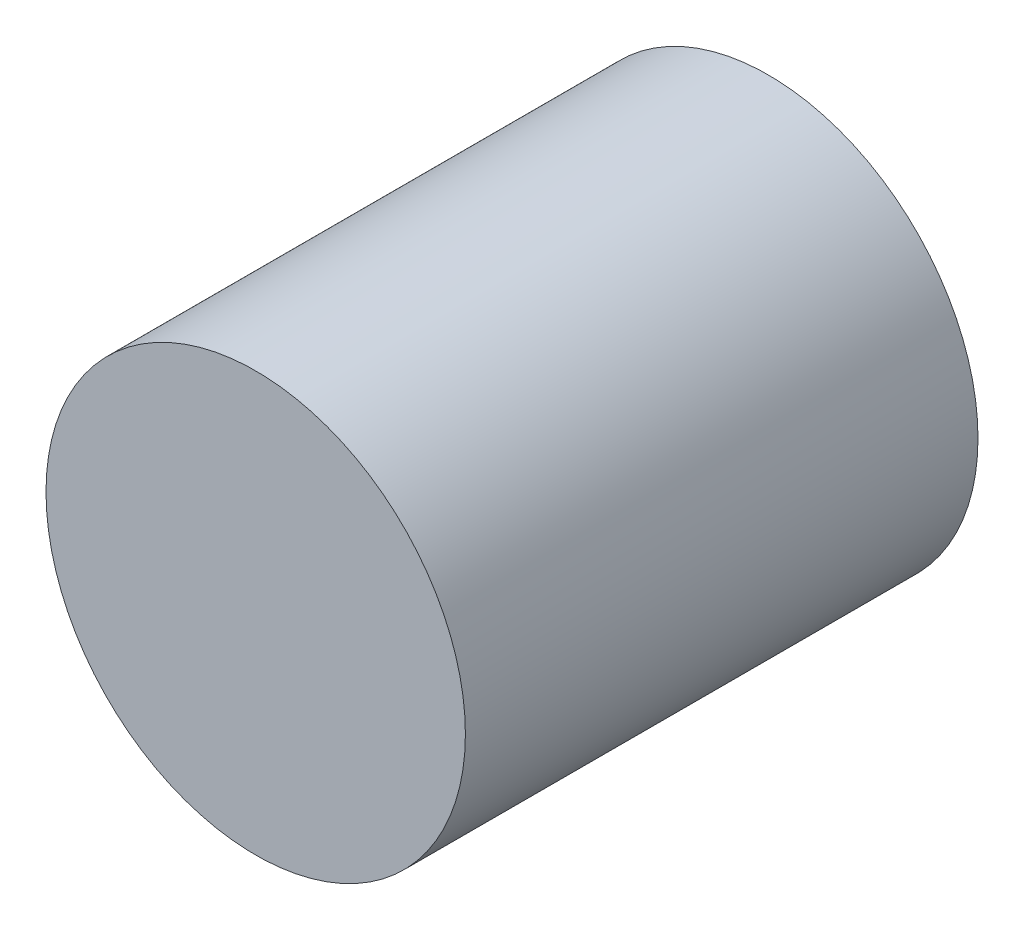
ISO-10303-21;
HEADER;
FILE_DESCRIPTION(('STEP AP214'),'2;1');
FILE_NAME('part.step','',(''),(''),'','','');
FILE_SCHEMA(('AUTOMOTIVE_DESIGN { 1 0 10303 214 1 1 1 1 }'));
ENDSEC;
DATA;
#1=APPLICATION_CONTEXT('core data for automotive mechanical design processes');
#2=APPLICATION_PROTOCOL_DEFINITION('international standard','automotive_design',2000,#1);
#3=PRODUCT_CONTEXT('',#1,'mechanical');
#4=PRODUCT('Part','Part','',(#3));
#5=PRODUCT_RELATED_PRODUCT_CATEGORY('part','',(#4));
#6=PRODUCT_DEFINITION_FORMATION('','',#4);
#7=PRODUCT_DEFINITION_CONTEXT('part definition',#1,'design');
#8=PRODUCT_DEFINITION('design','',#6,#7);
#9=PRODUCT_DEFINITION_SHAPE('','',#8);
#10=(LENGTH_UNIT() NAMED_UNIT(*) SI_UNIT(.MILLI.,.METRE.));
#11=(NAMED_UNIT(*) PLANE_ANGLE_UNIT() SI_UNIT($,.RADIAN.));
#12=(NAMED_UNIT(*) SI_UNIT($,.STERADIAN.) SOLID_ANGLE_UNIT());
#13=UNCERTAINTY_MEASURE_WITH_UNIT(LENGTH_MEASURE(1.E-05),#10,'distance_accuracy_value','');
#14=(GEOMETRIC_REPRESENTATION_CONTEXT(3) GLOBAL_UNCERTAINTY_ASSIGNED_CONTEXT((#13)) GLOBAL_UNIT_ASSIGNED_CONTEXT((#10,
#11,#12)) REPRESENTATION_CONTEXT('',''));
#15=CARTESIAN_POINT('',(0.,0.,0.));
#16=DIRECTION('',(0.,0.,1.));
#17=DIRECTION('',(1.,0.,0.));
#18=AXIS2_PLACEMENT_3D('',#15,#16,#17);
#19=CARTESIAN_POINT('',(0.,0.,5.));
#20=DIRECTION('',(0.,0.,-1.));
#21=DIRECTION('',(-1.,0.,0.));
#22=AXIS2_PLACEMENT_3D('',#19,#20,#21);
#23=CYLINDRICAL_SURFACE('',#22,4.5);
#24=CARTESIAN_POINT('',(0.,0.,-5.));
#25=DIRECTION('',(0.,0.,1.));
#26=DIRECTION('',(1.,0.,0.));
#27=AXIS2_PLACEMENT_3D('',#24,#25,#26);
#28=CIRCLE('',#27,4.5);
#29=CARTESIAN_POINT('',(4.5,0.,-5.));
#30=VERTEX_POINT('',#29);
#31=EDGE_CURVE('E10',#30,#30,#28,.T.);
#32=ORIENTED_EDGE('',*,*,#31,.T.);
#33=EDGE_LOOP('',(#32));
#34=FACE_BOUND('',#33,.T.);
#35=CARTESIAN_POINT('',(0.,0.,6.));
#36=DIRECTION('',(0.,0.,1.));
#37=DIRECTION('',(1.,0.,0.));
#38=AXIS2_PLACEMENT_3D('',#35,#36,#37);
#39=CIRCLE('',#38,4.5);
#40=CARTESIAN_POINT('',(4.5,0.,6.));
#41=VERTEX_POINT('',#40);
#42=EDGE_CURVE('E55',#41,#41,#39,.T.);
#43=ORIENTED_EDGE('',*,*,#42,.F.);
#44=EDGE_LOOP('',(#43));
#45=FACE_BOUND('',#44,.T.);
#46=ADVANCED_FACE('F41',(#34,#45),#23,.T.);
#47=CARTESIAN_POINT('',(0.,0.,-5.));
#48=DIRECTION('',(0.,0.,1.));
#49=DIRECTION('',(1.,0.,0.));
#50=AXIS2_PLACEMENT_3D('',#47,#48,#49);
#51=PLANE('',#50);
#52=CARTESIAN_POINT('',(0.,0.,-5.));
#53=DIRECTION('',(0.,0.,1.));
#54=DIRECTION('',(1.,0.,0.));
#55=AXIS2_PLACEMENT_3D('',#52,#53,#54);
#56=CIRCLE('',#55,4.425);
#57=CARTESIAN_POINT('',(4.425,0.,-5.));
#58=VERTEX_POINT('',#57);
#59=EDGE_CURVE('E44',#58,#58,#56,.T.);
#60=ORIENTED_EDGE('',*,*,#59,.T.);
#61=EDGE_LOOP('',(#60));
#62=FACE_BOUND('',#61,.T.);
#63=ORIENTED_EDGE('',*,*,#31,.F.);
#64=EDGE_LOOP('',(#63));
#65=FACE_BOUND('',#64,.T.);
#66=ADVANCED_FACE('F62',(#62,#65),#51,.F.);
#67=CARTESIAN_POINT('',(0.,0.,-249.));
#68=DIRECTION('',(0.,0.,1.));
#69=DIRECTION('',(1.,0.,0.));
#70=AXIS2_PLACEMENT_3D('',#67,#68,#69);
#71=CYLINDRICAL_SURFACE('',#70,4.425);
#72=CARTESIAN_POINT('',(0.,0.,5.));
#73=DIRECTION('',(0.,0.,1.));
#74=DIRECTION('',(1.,0.,0.));
#75=AXIS2_PLACEMENT_3D('',#72,#73,#74);
#76=CIRCLE('',#75,4.425);
#77=CARTESIAN_POINT('',(4.425,0.,5.));
#78=VERTEX_POINT('',#77);
#79=EDGE_CURVE('E51',#78,#78,#76,.T.);
#80=ORIENTED_EDGE('',*,*,#79,.T.);
#81=EDGE_LOOP('',(#80));
#82=FACE_BOUND('',#81,.T.);
#83=ORIENTED_EDGE('',*,*,#59,.F.);
#84=EDGE_LOOP('',(#83));
#85=FACE_BOUND('',#84,.T.);
#86=ADVANCED_FACE('F68',(#82,#85),#71,.F.);
#87=CARTESIAN_POINT('',(0.,0.,5.));
#88=DIRECTION('',(0.,0.,1.));
#89=DIRECTION('',(1.,0.,0.));
#90=AXIS2_PLACEMENT_3D('',#87,#88,#89);
#91=PLANE('',#90);
#92=ORIENTED_EDGE('',*,*,#79,.F.);
#93=EDGE_LOOP('',(#92));
#94=FACE_BOUND('',#93,.T.);
#95=ADVANCED_FACE('F72',(#94),#91,.F.);
#96=CARTESIAN_POINT('',(0.,0.,6.));
#97=DIRECTION('',(0.,0.,1.));
#98=DIRECTION('',(1.,0.,0.));
#99=AXIS2_PLACEMENT_3D('',#96,#97,#98);
#100=PLANE('',#99);
#101=ORIENTED_EDGE('',*,*,#42,.T.);
#102=EDGE_LOOP('',(#101));
#103=FACE_BOUND('',#102,.T.);
#104=ADVANCED_FACE('F59',(#103),#100,.T.);
#105=CLOSED_SHELL('',(#46,#66,#86,#95,#104));
#106=MANIFOLD_SOLID_BREP('B2',#105);
#107=ADVANCED_BREP_SHAPE_REPRESENTATION('',(#18,#106),#14);
#108=SHAPE_DEFINITION_REPRESENTATION(#9,#107);
ENDSEC;
END-ISO-10303-21;
